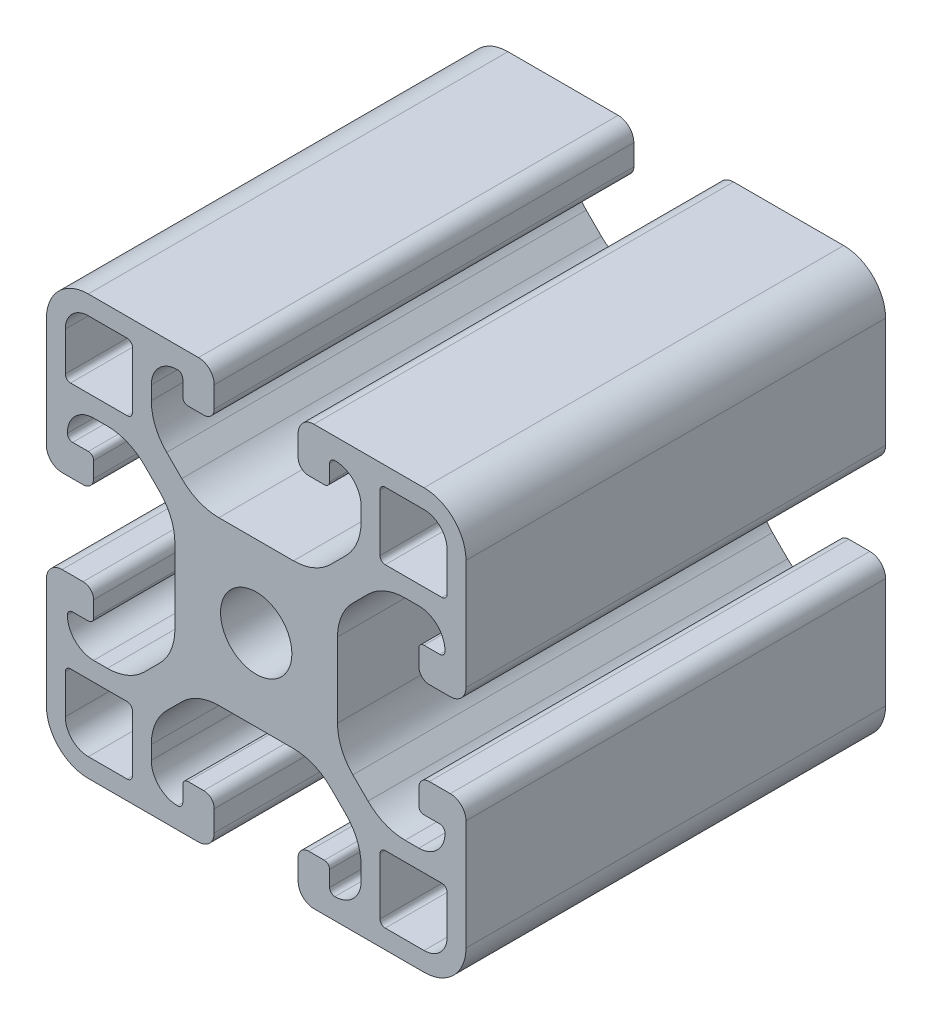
from build123d import *

# Parameters (mm, degrees)
SKETCH1_R           = 3.4
BOSS_EXTRUDE1_DEPTH = 20


with BuildPart() as part:
    # Sketch1 → Boss-Extrude1 (new, symmetric)
    with BuildSketch(Plane(origin=(0, 0, 0), x_dir=(-1, 0, 0), z_dir=(0, 0, -1))):
        with BuildLine():
            Line((-36.5, 16), (-38.5, 16))
            ThreePointArc((-38.5, 16), (-39.560660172, 15.560660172), (-40, 14.5))
            Line((-40, 14.5), (-40, 4))
            ThreePointArc((-40, 4), (-38.828427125, 1.171572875), (-36, 0))
            Line((-36, 0), (-25.5, 0))
            ThreePointArc((-25.5, 0), (-24.439339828, 0.439339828), (-24, 1.5))
            Line((-24, 1.5), (-24, 3.5))
            ThreePointArc((-24, 3.5), (-24.292893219, 4.207106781), (-25, 4.5))
            Line((-25, 4.5), (-26.5, 4.5))
            ThreePointArc((-26.5, 4.5), (-26.853553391, 4.353553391), (-27, 4))
            Line((-27, 4), (-27, 2.5))
            ThreePointArc((-27, 2.5), (-27.146446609, 2.146446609), (-27.5, 2))
            ThreePointArc((-27.5, 2), (-29.267766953, 2.732233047), (-30, 4.5))
            Line((-30, 4.5), (-30, 5.807611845))
            ThreePointArc((-30, 5.807611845), (-29.619397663, 7.721029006), (-28.535533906, 9.343145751))
            Line((-28.535533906, 9.343145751), (-27.09314575, 10.785533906))
            ThreePointArc((-27.09314575, 10.785533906), (-25.471029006, 11.869397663), (-23.557611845, 12.25))
            Line((-23.557611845, 12.25), (-16.442388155, 12.25))
            ThreePointArc((-16.442388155, 12.25), (-14.528970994, 11.869397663), (-12.90685425, 10.785533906))
            Line((-12.90685425, 10.785533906), (-11.464466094, 9.343145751))
            ThreePointArc((-11.464466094, 9.343145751), (-10.380602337, 7.721029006), (-10, 5.807611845))
            Line((-10, 5.807611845), (-10, 4.5))
            ThreePointArc((-10, 4.5), (-10.732233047, 2.732233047), (-12.5, 2))
            ThreePointArc((-12.5, 2), (-12.853553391, 2.146446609), (-13, 2.5))
            Line((-13, 2.5), (-13, 4))
            ThreePointArc((-13, 4), (-13.146446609, 4.353553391), (-13.5, 4.5))
            Line((-13.5, 4.5), (-15, 4.5))
            ThreePointArc((-15, 4.5), (-15.707106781, 4.207106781), (-16, 3.5))
            Line((-16, 3.5), (-16, 1.5))
            ThreePointArc((-16, 1.5), (-15.560660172, 0.439339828), (-14.5, 0))
            Line((-14.5, 0), (-4, 0))
            ThreePointArc((-4, 0), (-1.171572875, 1.171572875), (0, 4))
            Line((0, 4), (0, 14.5))
            ThreePointArc((0, 14.5), (-0.439339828, 15.560660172), (-1.5, 16))
            Line((-1.5, 16), (-3.5, 16))
            ThreePointArc((-3.5, 16), (-4.207106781, 15.707106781), (-4.5, 15))
            Line((-4.5, 15), (-4.5, 13.5))
            ThreePointArc((-4.5, 13.5), (-4.353553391, 13.146446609), (-4, 13))
            Line((-4, 13), (-2.5, 13))
            ThreePointArc((-2.5, 13), (-2.146446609, 12.853553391), (-2, 12.5))
            ThreePointArc((-2, 12.5), (-2.732233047, 10.732233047), (-4.5, 10))
            Line((-4.5, 10), (-5.807611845, 10))
            ThreePointArc((-5.807611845, 10), (-7.721029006, 10.380602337), (-9.343145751, 11.464466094))
            Line((-9.343145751, 11.464466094), (-10.785533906, 12.906854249))
            ThreePointArc((-10.785533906, 12.906854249), (-11.869397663, 14.528970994), (-12.25, 16.442388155))
            Line((-12.25, 16.442388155), (-12.25, 23.557611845))
            ThreePointArc((-12.25, 23.557611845), (-11.869397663, 25.471029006), (-10.785533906, 27.093145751))
            Line((-10.785533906, 27.093145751), (-9.343145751, 28.535533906))
            ThreePointArc((-9.343145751, 28.535533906), (-7.721029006, 29.619397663), (-5.807611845, 30))
            Line((-5.807611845, 30), (-4.5, 30))
            ThreePointArc((-4.5, 30), (-2.732233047, 29.267766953), (-2, 27.5))
            ThreePointArc((-2, 27.5), (-2.146446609, 27.146446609), (-2.5, 27))
            Line((-2.5, 27), (-4, 27))
            ThreePointArc((-4, 27), (-4.353553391, 26.853553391), (-4.5, 26.5))
            Line((-4.5, 26.5), (-4.5, 25))
            ThreePointArc((-4.5, 25), (-4.207106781, 24.292893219), (-3.5, 24))
            Line((-3.5, 24), (-1.5, 24))
            ThreePointArc((-1.5, 24), (-0.439339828, 24.439339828), (0, 25.5))
            Line((0, 25.5), (0, 36))
            ThreePointArc((0, 36), (-1.171572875, 38.828427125), (-4, 40))
            Line((-4, 40), (-14.5, 40))
            ThreePointArc((-14.5, 40), (-15.560660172, 39.560660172), (-16, 38.5))
            Line((-16, 38.5), (-16, 36.5))
            ThreePointArc((-16, 36.5), (-15.707106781, 35.792893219), (-15, 35.5))
            Line((-15, 35.5), (-13.5, 35.5))
            ThreePointArc((-13.5, 35.5), (-13.146446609, 35.646446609), (-13, 36))
            Line((-13, 36), (-13, 37.5))
            ThreePointArc((-13, 37.5), (-12.853553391, 37.853553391), (-12.5, 38))
            ThreePointArc((-12.5, 38), (-10.732233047, 37.267766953), (-10, 35.5))
            Line((-10, 35.5), (-10, 34.192388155))
            ThreePointArc((-10, 34.192388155), (-10.380602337, 32.278970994), (-11.464466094, 30.656854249))
            Line((-11.464466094, 30.656854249), (-12.90685425, 29.214466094))
            ThreePointArc((-12.90685425, 29.214466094), (-14.528970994, 28.130602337), (-16.442388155, 27.75))
            Line((-16.442388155, 27.75), (-23.557611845, 27.75))
            ThreePointArc((-23.557611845, 27.75), (-25.471029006, 28.130602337), (-27.09314575, 29.214466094))
            Line((-27.09314575, 29.214466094), (-28.535533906, 30.656854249))
            ThreePointArc((-28.535533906, 30.656854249), (-29.619397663, 32.278970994), (-30, 34.192388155))
            Line((-30, 34.192388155), (-30, 35.5))
            ThreePointArc((-30, 35.5), (-29.267766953, 37.267766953), (-27.5, 38))
            ThreePointArc((-27.5, 38), (-27.146446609, 37.853553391), (-27, 37.5))
            Line((-27, 37.5), (-27, 36))
            ThreePointArc((-27, 36), (-26.853553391, 35.646446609), (-26.5, 35.5))
            Line((-26.5, 35.5), (-25, 35.5))
            ThreePointArc((-25, 35.5), (-24.292893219, 35.792893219), (-24, 36.5))
            Line((-24, 36.5), (-24, 38.5))
            ThreePointArc((-24, 38.5), (-24.439339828, 39.560660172), (-25.5, 40))
            Line((-25.5, 40), (-36, 40))
            ThreePointArc((-36, 40), (-38.828427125, 38.828427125), (-40, 36))
            Line((-40, 36), (-40, 25.5))
            ThreePointArc((-40, 25.5), (-39.560660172, 24.439339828), (-38.5, 24))
            Line((-38.5, 24), (-36.5, 24))
            ThreePointArc((-36.5, 24), (-35.792893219, 24.292893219), (-35.5, 25))
            Line((-35.5, 25), (-35.5, 26.5))
            ThreePointArc((-35.5, 26.5), (-35.646446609, 26.853553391), (-36, 27))
            Line((-36, 27), (-37.5, 27))
            ThreePointArc((-37.5, 27), (-37.853553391, 27.146446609), (-38, 27.5))
            ThreePointArc((-38, 27.5), (-37.267766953, 29.267766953), (-35.5, 30))
            Line((-35.5, 30), (-34.192388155, 30))
            ThreePointArc((-34.192388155, 30), (-32.278970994, 29.619397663), (-30.656854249, 28.535533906))
            Line((-30.656854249, 28.535533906), (-29.214466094, 27.093145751))
            ThreePointArc((-29.214466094, 27.093145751), (-28.130602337, 25.471029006), (-27.75, 23.557611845))
            Line((-27.75, 23.557611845), (-27.75, 16.442388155))
            ThreePointArc((-27.75, 16.442388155), (-28.130602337, 14.528970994), (-29.214466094, 12.906854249))
            Line((-29.214466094, 12.906854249), (-30.656854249, 11.464466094))
            ThreePointArc((-30.656854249, 11.464466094), (-32.278970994, 10.380602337), (-34.192388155, 10))
            Line((-34.192388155, 10), (-35.5, 10))
            ThreePointArc((-35.5, 10), (-37.267766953, 10.732233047), (-38, 12.5))
            ThreePointArc((-38, 12.5), (-37.853553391, 12.853553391), (-37.5, 13))
            Line((-37.5, 13), (-36, 13))
            ThreePointArc((-36, 13), (-35.646446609, 13.146446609), (-35.5, 13.5))
            Line((-35.5, 13.5), (-35.5, 15))
            ThreePointArc((-35.5, 15), (-35.792893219, 15.707106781), (-36.5, 16))
        make_face()
        with Locations(Location((-20, 20, 0), (0, 0, 180))):
            Circle(SKETCH1_R, mode=Mode.SUBTRACT)
        with BuildLine():
            Line((-36, 38.2), (-32.3, 38.2))
            ThreePointArc((-32.3, 38.2), (-31.946446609, 38.053553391), (-31.8, 37.7))
            Line((-31.8, 37.7), (-31.8, 32.3))
            ThreePointArc((-31.8, 32.3), (-31.946446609, 31.946446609), (-32.3, 31.8))
            Line((-32.3, 31.8), (-37.7, 31.8))
            ThreePointArc((-37.7, 31.8), (-38.053553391, 31.946446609), (-38.2, 32.3))
            Line((-38.2, 32.3), (-38.2, 36))
            ThreePointArc((-38.2, 36), (-37.555634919, 37.555634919), (-36, 38.2))
        make_face(mode=Mode.SUBTRACT)
        with BuildLine():
            Line((-32.3, 1.8), (-36, 1.8))
            ThreePointArc((-36, 1.8), (-37.555634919, 2.444365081), (-38.2, 4))
            Line((-38.2, 4), (-38.2, 7.7))
            ThreePointArc((-38.2, 7.7), (-38.053553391, 8.053553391), (-37.7, 8.2))
            Line((-37.7, 8.2), (-32.3, 8.2))
            ThreePointArc((-32.3, 8.2), (-31.946446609, 8.053553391), (-31.8, 7.7))
            Line((-31.8, 7.7), (-31.8, 2.3))
            ThreePointArc((-31.8, 2.3), (-31.946446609, 1.946446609), (-32.3, 1.8))
        make_face(mode=Mode.SUBTRACT)
        with BuildLine():
            Line((-4, 1.8), (-7.7, 1.8))
            ThreePointArc((-7.7, 1.8), (-8.053553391, 1.946446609), (-8.2, 2.3))
            Line((-8.2, 2.3), (-8.2, 7.7))
            ThreePointArc((-8.2, 7.7), (-8.053553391, 8.053553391), (-7.7, 8.2))
            Line((-7.7, 8.2), (-2.3, 8.2))
            ThreePointArc((-2.3, 8.2), (-1.946446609, 8.053553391), (-1.8, 7.7))
            Line((-1.8, 7.7), (-1.8, 4))
            ThreePointArc((-1.8, 4), (-2.444365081, 2.444365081), (-4, 1.8))
        make_face(mode=Mode.SUBTRACT)
        with BuildLine():
            Line((-7.7, 38.2), (-4, 38.2))
            ThreePointArc((-4, 38.2), (-2.444365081, 37.555634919), (-1.8, 36))
            Line((-1.8, 36), (-1.8, 32.3))
            ThreePointArc((-1.8, 32.3), (-1.946446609, 31.946446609), (-2.3, 31.8))
            Line((-2.3, 31.8), (-7.7, 31.8))
            ThreePointArc((-7.7, 31.8), (-8.053553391, 31.946446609), (-8.2, 32.3))
            Line((-8.2, 32.3), (-8.2, 37.7))
            ThreePointArc((-8.2, 37.7), (-8.053553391, 38.053553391), (-7.7, 38.2))
        make_face(mode=Mode.SUBTRACT)
    extrude(amount=BOSS_EXTRUDE1_DEPTH, both=True)


solid = part.part
